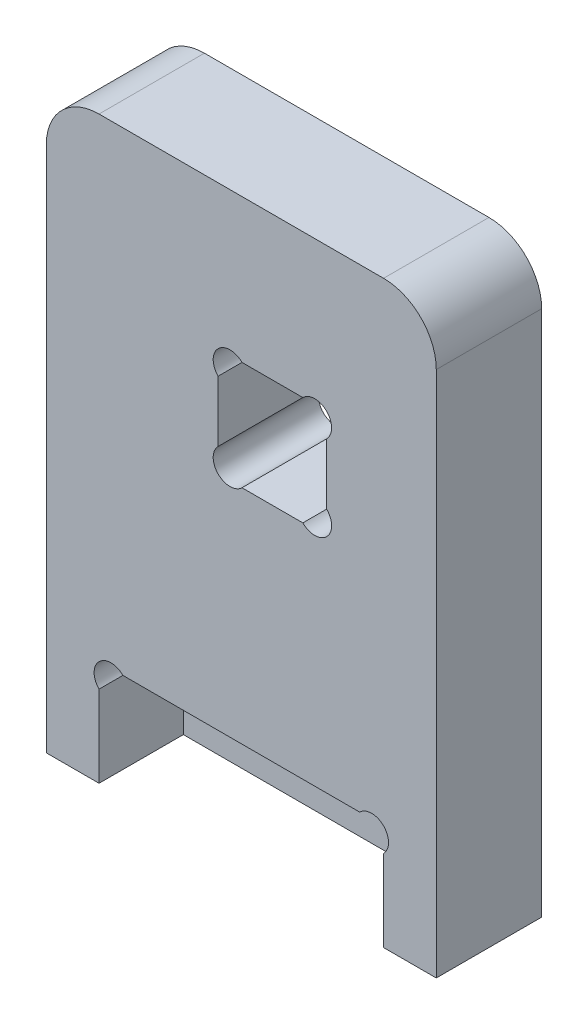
from build123d import *

# Parameters (mm, degrees)
ESQUISSE1_W             = 37
ESQUISSE1_H             = 55
BOSS_EXTRU_1_DEPTH      = 10
ENL_V_MAT_EXTRU_1_DEPTH = 8
CONG_1_R                = 5


with BuildPart() as part:
    # Esquisse1 → Boss.-Extru.1 (new body)
    with BuildSketch(Plane.XY):
        with Locations((0, -3.29)):
            Rectangle(ESQUISSE1_W, ESQUISSE1_H)
        with BuildLine():
            Line((8.1, 8.3172583), (8.1, 2.5427417))
            ThreePointArc((8.1, 2.5427417), (8.1, 0.28), (5.8372583, 0.28))
            Line((5.8372583, 0.28), (0.0627417, 0.28))
            ThreePointArc((0.0627417, 0.28), (-2.2, 0.28), (-2.2, 2.5427417))
            Line((-2.2, 2.5427417), (-2.2, 8.3172583))
            ThreePointArc((-2.2, 8.3172583), (-2.2, 10.58), (0.0627417, 10.58))
            Line((0.0627417, 10.58), (5.8372583, 10.58))
            ThreePointArc((5.8372583, 10.58), (8.1, 10.58), (8.1, 8.3172583))
        make_face(mode=Mode.SUBTRACT)
    extrude(amount=BOSS_EXTRU_1_DEPTH)

    # Esquisse2 → Enl_v. mat.-Extru.1 (cut)
    with BuildSketch(Plane.XY.offset(10)):
        with BuildLine():
            Line((-11.2372583, -20.79), (11.2372583, -20.79))
            ThreePointArc((11.2372583, -20.79), (13.5, -20.79), (13.5, -23.0527417))
            Line((13.5, -23.0527417), (13.5, -30.79))
            Line((13.5, -30.79), (-13.5, -30.79))
            Line((-13.5, -30.79), (-13.5, -23.0527417))
            ThreePointArc((-13.5, -23.0527417), (-13.5, -20.79), (-11.2372583, -20.79))
        make_face()
    extrude(amount=-ENL_V_MAT_EXTRU_1_DEPTH, mode=Mode.SUBTRACT)

    # Cong_1
    cong_1_edges = [part.edges().sort_by_distance(p)[0] for p in [
        (-18.5, 24.21, 5),
        (18.5, 24.21, 5),
    ]]
    fillet(cong_1_edges, radius=CONG_1_R)


solid = part.part
